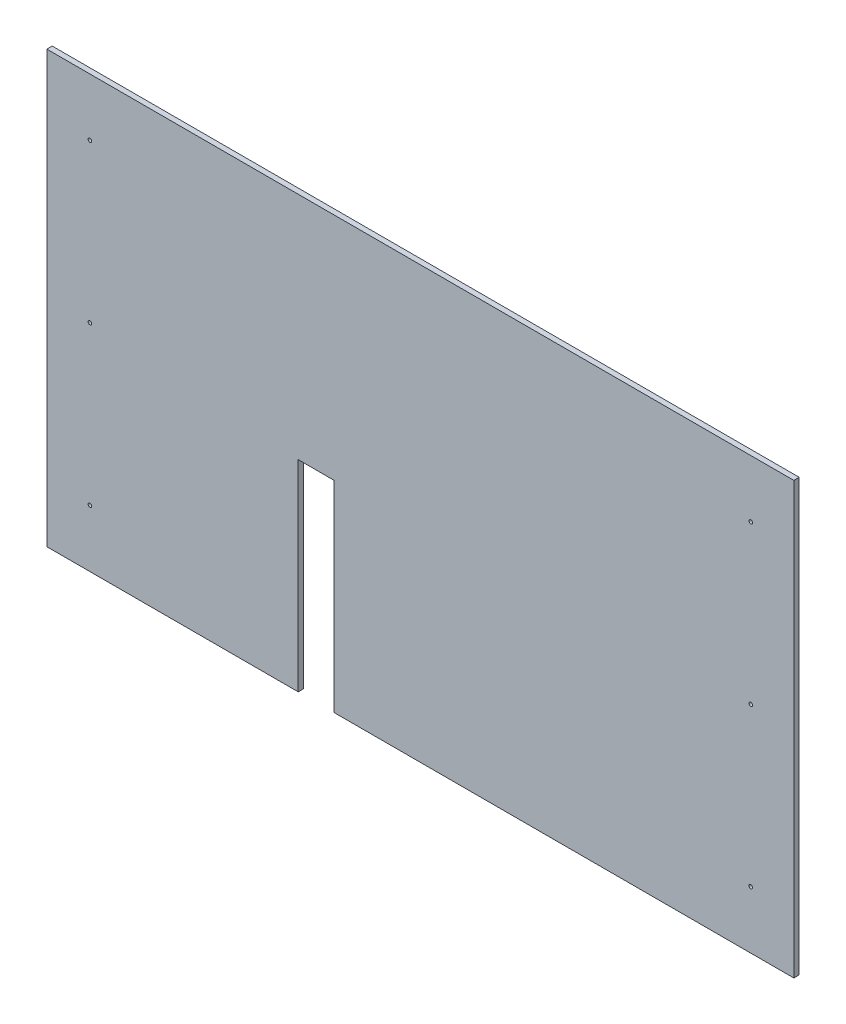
ISO-10303-21;
HEADER;
FILE_DESCRIPTION(('STEP AP214'),'2;1');
FILE_NAME('part.step','',(''),(''),'','','');
FILE_SCHEMA(('AUTOMOTIVE_DESIGN { 1 0 10303 214 1 1 1 1 }'));
ENDSEC;
DATA;
#1=APPLICATION_CONTEXT('core data for automotive mechanical design processes');
#2=APPLICATION_PROTOCOL_DEFINITION('international standard','automotive_design',2000,#1);
#3=PRODUCT_CONTEXT('',#1,'mechanical');
#4=PRODUCT('Part','Part','',(#3));
#5=PRODUCT_RELATED_PRODUCT_CATEGORY('part','',(#4));
#6=PRODUCT_DEFINITION_FORMATION('','',#4);
#7=PRODUCT_DEFINITION_CONTEXT('part definition',#1,'design');
#8=PRODUCT_DEFINITION('design','',#6,#7);
#9=PRODUCT_DEFINITION_SHAPE('','',#8);
#10=(LENGTH_UNIT() NAMED_UNIT(*) SI_UNIT(.MILLI.,.METRE.));
#11=(NAMED_UNIT(*) PLANE_ANGLE_UNIT() SI_UNIT($,.RADIAN.));
#12=(NAMED_UNIT(*) SI_UNIT($,.STERADIAN.) SOLID_ANGLE_UNIT());
#13=UNCERTAINTY_MEASURE_WITH_UNIT(LENGTH_MEASURE(1.E-05),#10,'distance_accuracy_value','');
#14=(GEOMETRIC_REPRESENTATION_CONTEXT(3) GLOBAL_UNCERTAINTY_ASSIGNED_CONTEXT((#13)) GLOBAL_UNIT_ASSIGNED_CONTEXT((#10,
#11,#12)) REPRESENTATION_CONTEXT('',''));
#15=CARTESIAN_POINT('',(0.,0.,0.));
#16=DIRECTION('',(0.,0.,1.));
#17=DIRECTION('',(1.,0.,0.));
#18=AXIS2_PLACEMENT_3D('',#15,#16,#17);
#19=CARTESIAN_POINT('',(0.,-190.5,2.3622));
#20=DIRECTION('',(0.,1.,0.));
#21=DIRECTION('',(0.,0.,1.));
#22=AXIS2_PLACEMENT_3D('',#19,#20,#21);
#23=PLANE('',#22);
#24=DIRECTION('',(1.,0.,0.));
#25=VECTOR('',#24,1.);
#26=CARTESIAN_POINT('',(0.,-190.5,2.3622));
#27=LINE('',#26,#25);
#28=CARTESIAN_POINT('',(127.,-190.5,2.3622));
#29=VERTEX_POINT('',#28);
#30=CARTESIAN_POINT('',(330.2,-190.5,2.3622));
#31=VERTEX_POINT('',#30);
#32=EDGE_CURVE('E123',#29,#31,#27,.T.);
#33=ORIENTED_EDGE('',*,*,#32,.F.);
#34=DIRECTION('',(0.,0.,-1.));
#35=VECTOR('',#34,1.);
#36=CARTESIAN_POINT('',(127.,-190.5,2.3622));
#37=LINE('',#36,#35);
#38=CARTESIAN_POINT('',(127.,-190.5,0.));
#39=VERTEX_POINT('',#38);
#40=EDGE_CURVE('E110',#29,#39,#37,.T.);
#41=ORIENTED_EDGE('',*,*,#40,.T.);
#42=DIRECTION('',(1.,0.,0.));
#43=VECTOR('',#42,1.);
#44=CARTESIAN_POINT('',(0.,-190.5,0.));
#45=LINE('',#44,#43);
#46=CARTESIAN_POINT('',(330.2,-190.5,0.));
#47=VERTEX_POINT('',#46);
#48=EDGE_CURVE('E143',#39,#47,#45,.T.);
#49=ORIENTED_EDGE('',*,*,#48,.T.);
#50=DIRECTION('',(0.,0.,-1.));
#51=VECTOR('',#50,1.);
#52=CARTESIAN_POINT('',(330.2,-190.5,2.3622));
#53=LINE('',#52,#51);
#54=EDGE_CURVE('E43',#31,#47,#53,.T.);
#55=ORIENTED_EDGE('',*,*,#54,.F.);
#56=EDGE_LOOP('',(#33,#41,#49,#55));
#57=FACE_BOUND('',#56,.T.);
#58=ADVANCED_FACE('F35',(#57),#23,.F.);
#59=CARTESIAN_POINT('',(0.,0.,2.3622));
#60=DIRECTION('',(1.,0.,0.));
#61=DIRECTION('',(0.,1.,0.));
#62=AXIS2_PLACEMENT_3D('',#59,#60,#61);
#63=PLANE('',#62);
#64=DIRECTION('',(0.,-1.,0.));
#65=VECTOR('',#64,1.);
#66=CARTESIAN_POINT('',(0.,0.,0.));
#67=LINE('',#66,#65);
#68=CARTESIAN_POINT('',(0.,0.,0.));
#69=VERTEX_POINT('',#68);
#70=CARTESIAN_POINT('',(0.,-190.5,0.));
#71=VERTEX_POINT('',#70);
#72=EDGE_CURVE('E140',#69,#71,#67,.T.);
#73=ORIENTED_EDGE('',*,*,#72,.T.);
#74=DIRECTION('',(0.,0.,-1.));
#75=VECTOR('',#74,1.);
#76=CARTESIAN_POINT('',(0.,-190.5,2.3622));
#77=LINE('',#76,#75);
#78=CARTESIAN_POINT('',(0.,-190.5,2.3622));
#79=VERTEX_POINT('',#78);
#80=EDGE_CURVE('E11',#79,#71,#77,.T.);
#81=ORIENTED_EDGE('',*,*,#80,.F.);
#82=DIRECTION('',(0.,-1.,0.));
#83=VECTOR('',#82,1.);
#84=CARTESIAN_POINT('',(0.,0.,2.3622));
#85=LINE('',#84,#83);
#86=CARTESIAN_POINT('',(0.,0.,2.3622));
#87=VERTEX_POINT('',#86);
#88=EDGE_CURVE('E132',#87,#79,#85,.T.);
#89=ORIENTED_EDGE('',*,*,#88,.F.);
#90=DIRECTION('',(0.,0.,-1.));
#91=VECTOR('',#90,1.);
#92=CARTESIAN_POINT('',(0.,0.,2.3622));
#93=LINE('',#92,#91);
#94=EDGE_CURVE('E139',#87,#69,#93,.T.);
#95=ORIENTED_EDGE('',*,*,#94,.T.);
#96=EDGE_LOOP('',(#73,#81,#89,#95));
#97=FACE_BOUND('',#96,.T.);
#98=ADVANCED_FACE('F37',(#97),#63,.F.);
#99=CARTESIAN_POINT('',(111.125,-190.5,0.));
#100=VERTEX_POINT('',#99);
#101=EDGE_CURVE('E145',#71,#100,#45,.T.);
#102=ORIENTED_EDGE('',*,*,#101,.T.);
#103=DIRECTION('',(0.,0.,-1.));
#104=VECTOR('',#103,1.);
#105=CARTESIAN_POINT('',(111.125,-190.5,2.3622));
#106=LINE('',#105,#104);
#107=CARTESIAN_POINT('',(111.125,-190.5,2.3622));
#108=VERTEX_POINT('',#107);
#109=EDGE_CURVE('E50',#108,#100,#106,.T.);
#110=ORIENTED_EDGE('',*,*,#109,.F.);
#111=EDGE_CURVE('E86',#79,#108,#27,.T.);
#112=ORIENTED_EDGE('',*,*,#111,.F.);
#113=ORIENTED_EDGE('',*,*,#80,.T.);
#114=EDGE_LOOP('',(#102,#110,#112,#113));
#115=FACE_BOUND('',#114,.T.);
#116=ADVANCED_FACE('F172',(#115),#23,.F.);
#117=CARTESIAN_POINT('',(330.2,0.,2.3622));
#118=DIRECTION('',(-1.,0.,0.));
#119=DIRECTION('',(0.,0.,1.));
#120=AXIS2_PLACEMENT_3D('',#117,#118,#119);
#121=PLANE('',#120);
#122=DIRECTION('',(0.,1.,0.));
#123=VECTOR('',#122,1.);
#124=CARTESIAN_POINT('',(330.2,0.,0.));
#125=LINE('',#124,#123);
#126=CARTESIAN_POINT('',(330.2,0.,0.));
#127=VERTEX_POINT('',#126);
#128=EDGE_CURVE('E148',#47,#127,#125,.T.);
#129=ORIENTED_EDGE('',*,*,#128,.T.);
#130=DIRECTION('',(0.,0.,-1.));
#131=VECTOR('',#130,1.);
#132=CARTESIAN_POINT('',(330.2,0.,2.3622));
#133=LINE('',#132,#131);
#134=CARTESIAN_POINT('',(330.2,0.,2.3622));
#135=VERTEX_POINT('',#134);
#136=EDGE_CURVE('E152',#135,#127,#133,.T.);
#137=ORIENTED_EDGE('',*,*,#136,.F.);
#138=DIRECTION('',(0.,1.,0.));
#139=VECTOR('',#138,1.);
#140=CARTESIAN_POINT('',(330.2,0.,2.3622));
#141=LINE('',#140,#139);
#142=EDGE_CURVE('E134',#31,#135,#141,.T.);
#143=ORIENTED_EDGE('',*,*,#142,.F.);
#144=ORIENTED_EDGE('',*,*,#54,.T.);
#145=EDGE_LOOP('',(#129,#137,#143,#144));
#146=FACE_BOUND('',#145,.T.);
#147=ADVANCED_FACE('F155',(#146),#121,.F.);
#148=CARTESIAN_POINT('',(0.,0.,2.3622));
#149=DIRECTION('',(0.,-1.,0.));
#150=DIRECTION('',(0.,0.,-1.));
#151=AXIS2_PLACEMENT_3D('',#148,#149,#150);
#152=PLANE('',#151);
#153=DIRECTION('',(-1.,0.,0.));
#154=VECTOR('',#153,1.);
#155=CARTESIAN_POINT('',(0.,0.,0.));
#156=LINE('',#155,#154);
#157=EDGE_CURVE('E80',#127,#69,#156,.T.);
#158=ORIENTED_EDGE('',*,*,#157,.T.);
#159=ORIENTED_EDGE('',*,*,#94,.F.);
#160=DIRECTION('',(-1.,0.,0.));
#161=VECTOR('',#160,1.);
#162=CARTESIAN_POINT('',(0.,0.,2.3622));
#163=LINE('',#162,#161);
#164=EDGE_CURVE('E59',#135,#87,#163,.T.);
#165=ORIENTED_EDGE('',*,*,#164,.F.);
#166=ORIENTED_EDGE('',*,*,#136,.T.);
#167=EDGE_LOOP('',(#158,#159,#165,#166));
#168=FACE_BOUND('',#167,.T.);
#169=ADVANCED_FACE('F163',(#168),#152,.F.);
#170=CARTESIAN_POINT('',(0.,0.,2.3622));
#171=DIRECTION('',(0.,0.,1.));
#172=DIRECTION('',(1.,0.,0.));
#173=AXIS2_PLACEMENT_3D('',#170,#171,#172);
#174=PLANE('',#173);
#175=CARTESIAN_POINT('',(19.05,-25.4,2.3622));
#176=DIRECTION('',(0.,0.,1.));
#177=DIRECTION('',(1.,0.,0.));
#178=AXIS2_PLACEMENT_3D('',#175,#176,#177);
#179=CIRCLE('',#178,0.793749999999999);
#180=CARTESIAN_POINT('',(19.84375,-25.4,2.3622));
#181=VERTEX_POINT('',#180);
#182=EDGE_CURVE('E259',#181,#181,#179,.T.);
#183=ORIENTED_EDGE('',*,*,#182,.F.);
#184=EDGE_LOOP('',(#183));
#185=FACE_BOUND('',#184,.T.);
#186=CARTESIAN_POINT('',(19.05,-95.25,2.3622));
#187=DIRECTION('',(0.,0.,1.));
#188=DIRECTION('',(1.,0.,0.));
#189=AXIS2_PLACEMENT_3D('',#186,#187,#188);
#190=CIRCLE('',#189,0.793749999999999);
#191=CARTESIAN_POINT('',(19.84375,-95.25,2.3622));
#192=VERTEX_POINT('',#191);
#193=EDGE_CURVE('E255',#192,#192,#190,.T.);
#194=ORIENTED_EDGE('',*,*,#193,.F.);
#195=EDGE_LOOP('',(#194));
#196=FACE_BOUND('',#195,.T.);
#197=CARTESIAN_POINT('',(19.05,-165.1,2.3622));
#198=DIRECTION('',(0.,0.,1.));
#199=DIRECTION('',(1.,0.,0.));
#200=AXIS2_PLACEMENT_3D('',#197,#198,#199);
#201=CIRCLE('',#200,0.793749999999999);
#202=CARTESIAN_POINT('',(19.84375,-165.1,2.3622));
#203=VERTEX_POINT('',#202);
#204=EDGE_CURVE('E251',#203,#203,#201,.T.);
#205=ORIENTED_EDGE('',*,*,#204,.F.);
#206=EDGE_LOOP('',(#205));
#207=FACE_BOUND('',#206,.T.);
#208=CARTESIAN_POINT('',(311.15,-25.4,2.3622));
#209=DIRECTION('',(0.,0.,1.));
#210=DIRECTION('',(1.,0.,0.));
#211=AXIS2_PLACEMENT_3D('',#208,#209,#210);
#212=CIRCLE('',#211,0.793749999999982);
#213=CARTESIAN_POINT('',(311.94375,-25.4,2.3622));
#214=VERTEX_POINT('',#213);
#215=EDGE_CURVE('E247',#214,#214,#212,.T.);
#216=ORIENTED_EDGE('',*,*,#215,.F.);
#217=EDGE_LOOP('',(#216));
#218=FACE_BOUND('',#217,.T.);
#219=CARTESIAN_POINT('',(311.15,-95.25,2.3622));
#220=DIRECTION('',(0.,0.,1.));
#221=DIRECTION('',(1.,0.,0.));
#222=AXIS2_PLACEMENT_3D('',#219,#220,#221);
#223=CIRCLE('',#222,0.793749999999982);
#224=CARTESIAN_POINT('',(311.94375,-95.25,2.3622));
#225=VERTEX_POINT('',#224);
#226=EDGE_CURVE('E243',#225,#225,#223,.T.);
#227=ORIENTED_EDGE('',*,*,#226,.F.);
#228=EDGE_LOOP('',(#227));
#229=FACE_BOUND('',#228,.T.);
#230=CARTESIAN_POINT('',(311.15,-165.1,2.3622));
#231=DIRECTION('',(0.,0.,1.));
#232=DIRECTION('',(1.,0.,0.));
#233=AXIS2_PLACEMENT_3D('',#230,#231,#232);
#234=CIRCLE('',#233,0.793749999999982);
#235=CARTESIAN_POINT('',(311.94375,-165.1,2.3622));
#236=VERTEX_POINT('',#235);
#237=EDGE_CURVE('E238',#236,#236,#234,.T.);
#238=ORIENTED_EDGE('',*,*,#237,.F.);
#239=EDGE_LOOP('',(#238));
#240=FACE_BOUND('',#239,.T.);
#241=DIRECTION('',(0.,-1.,0.));
#242=VECTOR('',#241,1.);
#243=CARTESIAN_POINT('',(127.,-101.6,2.3622));
#244=LINE('',#243,#242);
#245=CARTESIAN_POINT('',(127.,-101.6,2.3622));
#246=VERTEX_POINT('',#245);
#247=EDGE_CURVE('E113',#246,#29,#244,.T.);
#248=ORIENTED_EDGE('',*,*,#247,.T.);
#249=ORIENTED_EDGE('',*,*,#32,.T.);
#250=ORIENTED_EDGE('',*,*,#142,.T.);
#251=ORIENTED_EDGE('',*,*,#164,.T.);
#252=ORIENTED_EDGE('',*,*,#88,.T.);
#253=ORIENTED_EDGE('',*,*,#111,.T.);
#254=DIRECTION('',(0.,1.,0.));
#255=VECTOR('',#254,1.);
#256=CARTESIAN_POINT('',(111.125,-101.6,2.3622));
#257=LINE('',#256,#255);
#258=CARTESIAN_POINT('',(111.125,-101.6,2.3622));
#259=VERTEX_POINT('',#258);
#260=EDGE_CURVE('E127',#108,#259,#257,.T.);
#261=ORIENTED_EDGE('',*,*,#260,.T.);
#262=DIRECTION('',(1.,0.,0.));
#263=VECTOR('',#262,1.);
#264=CARTESIAN_POINT('',(127.,-101.6,2.3622));
#265=LINE('',#264,#263);
#266=EDGE_CURVE('E120',#259,#246,#265,.T.);
#267=ORIENTED_EDGE('',*,*,#266,.T.);
#268=EDGE_LOOP('',(#248,#249,#250,#251,#252,#253,#261,#267));
#269=FACE_BOUND('',#268,.T.);
#270=ADVANCED_FACE('F122',(#185,#196,#207,#218,#229,#240,#269),#174,.T.);
#271=CARTESIAN_POINT('',(0.,0.,0.));
#272=DIRECTION('',(0.,0.,1.));
#273=DIRECTION('',(1.,0.,0.));
#274=AXIS2_PLACEMENT_3D('',#271,#272,#273);
#275=PLANE('',#274);
#276=CARTESIAN_POINT('',(19.05,-25.4,0.));
#277=DIRECTION('',(0.,0.,1.));
#278=DIRECTION('',(1.,0.,0.));
#279=AXIS2_PLACEMENT_3D('',#276,#277,#278);
#280=CIRCLE('',#279,0.793749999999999);
#281=CARTESIAN_POINT('',(19.84375,-25.4,0.));
#282=VERTEX_POINT('',#281);
#283=EDGE_CURVE('E219',#282,#282,#280,.T.);
#284=ORIENTED_EDGE('',*,*,#283,.T.);
#285=EDGE_LOOP('',(#284));
#286=FACE_BOUND('',#285,.T.);
#287=CARTESIAN_POINT('',(19.05,-95.25,0.));
#288=DIRECTION('',(0.,0.,1.));
#289=DIRECTION('',(1.,0.,0.));
#290=AXIS2_PLACEMENT_3D('',#287,#288,#289);
#291=CIRCLE('',#290,0.793749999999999);
#292=CARTESIAN_POINT('',(19.84375,-95.25,0.));
#293=VERTEX_POINT('',#292);
#294=EDGE_CURVE('E223',#293,#293,#291,.T.);
#295=ORIENTED_EDGE('',*,*,#294,.T.);
#296=EDGE_LOOP('',(#295));
#297=FACE_BOUND('',#296,.T.);
#298=CARTESIAN_POINT('',(19.05,-165.1,0.));
#299=DIRECTION('',(0.,0.,1.));
#300=DIRECTION('',(1.,0.,0.));
#301=AXIS2_PLACEMENT_3D('',#298,#299,#300);
#302=CIRCLE('',#301,0.793749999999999);
#303=CARTESIAN_POINT('',(19.84375,-165.1,0.));
#304=VERTEX_POINT('',#303);
#305=EDGE_CURVE('E227',#304,#304,#302,.T.);
#306=ORIENTED_EDGE('',*,*,#305,.T.);
#307=EDGE_LOOP('',(#306));
#308=FACE_BOUND('',#307,.T.);
#309=CARTESIAN_POINT('',(311.15,-25.4,0.));
#310=DIRECTION('',(0.,0.,1.));
#311=DIRECTION('',(1.,0.,0.));
#312=AXIS2_PLACEMENT_3D('',#309,#310,#311);
#313=CIRCLE('',#312,0.793749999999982);
#314=CARTESIAN_POINT('',(311.94375,-25.4,0.));
#315=VERTEX_POINT('',#314);
#316=EDGE_CURVE('E231',#315,#315,#313,.T.);
#317=ORIENTED_EDGE('',*,*,#316,.T.);
#318=EDGE_LOOP('',(#317));
#319=FACE_BOUND('',#318,.T.);
#320=CARTESIAN_POINT('',(311.15,-95.25,0.));
#321=DIRECTION('',(0.,0.,1.));
#322=DIRECTION('',(1.,0.,0.));
#323=AXIS2_PLACEMENT_3D('',#320,#321,#322);
#324=CIRCLE('',#323,0.793749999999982);
#325=CARTESIAN_POINT('',(311.94375,-95.25,0.));
#326=VERTEX_POINT('',#325);
#327=EDGE_CURVE('E235',#326,#326,#324,.T.);
#328=ORIENTED_EDGE('',*,*,#327,.T.);
#329=EDGE_LOOP('',(#328));
#330=FACE_BOUND('',#329,.T.);
#331=CARTESIAN_POINT('',(311.15,-165.1,0.));
#332=DIRECTION('',(0.,0.,1.));
#333=DIRECTION('',(1.,0.,0.));
#334=AXIS2_PLACEMENT_3D('',#331,#332,#333);
#335=CIRCLE('',#334,0.793749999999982);
#336=CARTESIAN_POINT('',(311.94375,-165.1,0.));
#337=VERTEX_POINT('',#336);
#338=EDGE_CURVE('E190',#337,#337,#335,.T.);
#339=ORIENTED_EDGE('',*,*,#338,.T.);
#340=EDGE_LOOP('',(#339));
#341=FACE_BOUND('',#340,.T.);
#342=ORIENTED_EDGE('',*,*,#48,.F.);
#343=DIRECTION('',(0.,-1.,0.));
#344=VECTOR('',#343,1.);
#345=CARTESIAN_POINT('',(127.,-101.6,0.));
#346=LINE('',#345,#344);
#347=CARTESIAN_POINT('',(127.,-101.6,0.));
#348=VERTEX_POINT('',#347);
#349=EDGE_CURVE('E116',#348,#39,#346,.T.);
#350=ORIENTED_EDGE('',*,*,#349,.F.);
#351=DIRECTION('',(1.,0.,0.));
#352=VECTOR('',#351,1.);
#353=CARTESIAN_POINT('',(127.,-101.6,0.));
#354=LINE('',#353,#352);
#355=CARTESIAN_POINT('',(111.125,-101.6,0.));
#356=VERTEX_POINT('',#355);
#357=EDGE_CURVE('E128',#356,#348,#354,.T.);
#358=ORIENTED_EDGE('',*,*,#357,.F.);
#359=DIRECTION('',(0.,1.,0.));
#360=VECTOR('',#359,1.);
#361=CARTESIAN_POINT('',(111.125,-101.6,0.));
#362=LINE('',#361,#360);
#363=EDGE_CURVE('E189',#100,#356,#362,.T.);
#364=ORIENTED_EDGE('',*,*,#363,.F.);
#365=ORIENTED_EDGE('',*,*,#101,.F.);
#366=ORIENTED_EDGE('',*,*,#72,.F.);
#367=ORIENTED_EDGE('',*,*,#157,.F.);
#368=ORIENTED_EDGE('',*,*,#128,.F.);
#369=EDGE_LOOP('',(#342,#350,#358,#364,#365,#366,#367,#368));
#370=FACE_BOUND('',#369,.T.);
#371=ADVANCED_FACE('F158',(#286,#297,#308,#319,#330,#341,#370),#275,.F.);
#372=CARTESIAN_POINT('',(127.,-101.6,2.3622));
#373=DIRECTION('',(1.,0.,0.));
#374=DIRECTION('',(0.,0.,-1.));
#375=AXIS2_PLACEMENT_3D('',#372,#373,#374);
#376=PLANE('',#375);
#377=ORIENTED_EDGE('',*,*,#349,.T.);
#378=ORIENTED_EDGE('',*,*,#40,.F.);
#379=ORIENTED_EDGE('',*,*,#247,.F.);
#380=DIRECTION('',(0.,0.,-1.));
#381=VECTOR('',#380,1.);
#382=CARTESIAN_POINT('',(127.,-101.6,2.3622));
#383=LINE('',#382,#381);
#384=EDGE_CURVE('E144',#246,#348,#383,.T.);
#385=ORIENTED_EDGE('',*,*,#384,.T.);
#386=EDGE_LOOP('',(#377,#378,#379,#385));
#387=FACE_BOUND('',#386,.T.);
#388=ADVANCED_FACE('F112',(#387),#376,.F.);
#389=CARTESIAN_POINT('',(127.,-101.6,2.3622));
#390=DIRECTION('',(0.,1.,0.));
#391=DIRECTION('',(0.,0.,1.));
#392=AXIS2_PLACEMENT_3D('',#389,#390,#391);
#393=PLANE('',#392);
#394=ORIENTED_EDGE('',*,*,#357,.T.);
#395=ORIENTED_EDGE('',*,*,#384,.F.);
#396=ORIENTED_EDGE('',*,*,#266,.F.);
#397=DIRECTION('',(0.,0.,-1.));
#398=VECTOR('',#397,1.);
#399=CARTESIAN_POINT('',(111.125,-101.6,2.3622));
#400=LINE('',#399,#398);
#401=EDGE_CURVE('E182',#259,#356,#400,.T.);
#402=ORIENTED_EDGE('',*,*,#401,.T.);
#403=EDGE_LOOP('',(#394,#395,#396,#402));
#404=FACE_BOUND('',#403,.T.);
#405=ADVANCED_FACE('F196',(#404),#393,.F.);
#406=CARTESIAN_POINT('',(111.125,-101.6,2.3622));
#407=DIRECTION('',(-1.,0.,0.));
#408=DIRECTION('',(0.,0.,1.));
#409=AXIS2_PLACEMENT_3D('',#406,#407,#408);
#410=PLANE('',#409);
#411=ORIENTED_EDGE('',*,*,#363,.T.);
#412=ORIENTED_EDGE('',*,*,#401,.F.);
#413=ORIENTED_EDGE('',*,*,#260,.F.);
#414=ORIENTED_EDGE('',*,*,#109,.T.);
#415=EDGE_LOOP('',(#411,#412,#413,#414));
#416=FACE_BOUND('',#415,.T.);
#417=ADVANCED_FACE('F198',(#416),#410,.F.);
#418=CARTESIAN_POINT('',(311.15,-165.1,2.3622));
#419=DIRECTION('',(0.,0.,1.));
#420=DIRECTION('',(1.,0.,0.));
#421=AXIS2_PLACEMENT_3D('',#418,#419,#420);
#422=CYLINDRICAL_SURFACE('',#421,0.793749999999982);
#423=ORIENTED_EDGE('',*,*,#338,.F.);
#424=EDGE_LOOP('',(#423));
#425=FACE_BOUND('',#424,.T.);
#426=ORIENTED_EDGE('',*,*,#237,.T.);
#427=EDGE_LOOP('',(#426));
#428=FACE_BOUND('',#427,.T.);
#429=ADVANCED_FACE('F200',(#425,#428),#422,.F.);
#430=CARTESIAN_POINT('',(311.15,-95.25,2.3622));
#431=DIRECTION('',(0.,0.,1.));
#432=DIRECTION('',(1.,0.,0.));
#433=AXIS2_PLACEMENT_3D('',#430,#431,#432);
#434=CYLINDRICAL_SURFACE('',#433,0.793749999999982);
#435=ORIENTED_EDGE('',*,*,#327,.F.);
#436=EDGE_LOOP('',(#435));
#437=FACE_BOUND('',#436,.T.);
#438=ORIENTED_EDGE('',*,*,#226,.T.);
#439=EDGE_LOOP('',(#438));
#440=FACE_BOUND('',#439,.T.);
#441=ADVANCED_FACE('F206',(#437,#440),#434,.F.);
#442=CARTESIAN_POINT('',(311.15,-25.4,2.3622));
#443=DIRECTION('',(0.,0.,1.));
#444=DIRECTION('',(1.,0.,0.));
#445=AXIS2_PLACEMENT_3D('',#442,#443,#444);
#446=CYLINDRICAL_SURFACE('',#445,0.793749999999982);
#447=ORIENTED_EDGE('',*,*,#316,.F.);
#448=EDGE_LOOP('',(#447));
#449=FACE_BOUND('',#448,.T.);
#450=ORIENTED_EDGE('',*,*,#215,.T.);
#451=EDGE_LOOP('',(#450));
#452=FACE_BOUND('',#451,.T.);
#453=ADVANCED_FACE('F277',(#449,#452),#446,.F.);
#454=CARTESIAN_POINT('',(19.05,-165.1,2.3622));
#455=DIRECTION('',(0.,0.,1.));
#456=DIRECTION('',(1.,0.,0.));
#457=AXIS2_PLACEMENT_3D('',#454,#455,#456);
#458=CYLINDRICAL_SURFACE('',#457,0.793749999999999);
#459=ORIENTED_EDGE('',*,*,#305,.F.);
#460=EDGE_LOOP('',(#459));
#461=FACE_BOUND('',#460,.T.);
#462=ORIENTED_EDGE('',*,*,#204,.T.);
#463=EDGE_LOOP('',(#462));
#464=FACE_BOUND('',#463,.T.);
#465=ADVANCED_FACE('F283',(#461,#464),#458,.F.);
#466=CARTESIAN_POINT('',(19.05,-95.25,2.3622));
#467=DIRECTION('',(0.,0.,1.));
#468=DIRECTION('',(1.,0.,0.));
#469=AXIS2_PLACEMENT_3D('',#466,#467,#468);
#470=CYLINDRICAL_SURFACE('',#469,0.793749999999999);
#471=ORIENTED_EDGE('',*,*,#294,.F.);
#472=EDGE_LOOP('',(#471));
#473=FACE_BOUND('',#472,.T.);
#474=ORIENTED_EDGE('',*,*,#193,.T.);
#475=EDGE_LOOP('',(#474));
#476=FACE_BOUND('',#475,.T.);
#477=ADVANCED_FACE('F289',(#473,#476),#470,.F.);
#478=CARTESIAN_POINT('',(19.05,-25.4,2.3622));
#479=DIRECTION('',(0.,0.,1.));
#480=DIRECTION('',(1.,0.,0.));
#481=AXIS2_PLACEMENT_3D('',#478,#479,#480);
#482=CYLINDRICAL_SURFACE('',#481,0.793749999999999);
#483=ORIENTED_EDGE('',*,*,#283,.F.);
#484=EDGE_LOOP('',(#483));
#485=FACE_BOUND('',#484,.T.);
#486=ORIENTED_EDGE('',*,*,#182,.T.);
#487=EDGE_LOOP('',(#486));
#488=FACE_BOUND('',#487,.T.);
#489=ADVANCED_FACE('F263',(#485,#488),#482,.F.);
#490=CLOSED_SHELL('',(#58,#98,#116,#147,#169,#270,#371,#388,#405,#417,#429,#441,#453,#465,#477,#489));
#491=MANIFOLD_SOLID_BREP('B2',#490);
#492=ADVANCED_BREP_SHAPE_REPRESENTATION('',(#18,#491),#14);
#493=SHAPE_DEFINITION_REPRESENTATION(#9,#492);
ENDSEC;
END-ISO-10303-21;
